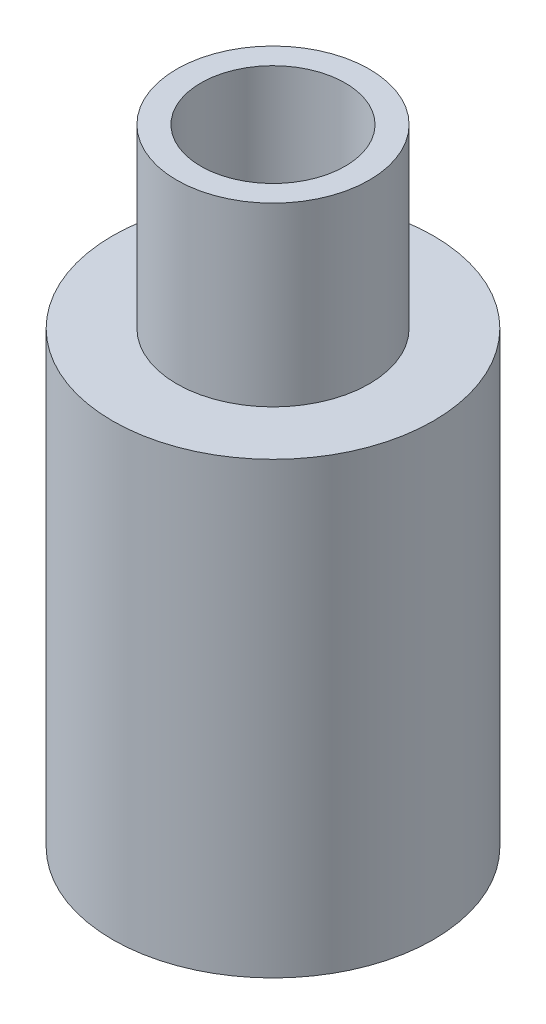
ISO-10303-21;
HEADER;
FILE_DESCRIPTION(('STEP AP214'),'2;1');
FILE_NAME('part.step','',(''),(''),'','','');
FILE_SCHEMA(('AUTOMOTIVE_DESIGN { 1 0 10303 214 1 1 1 1 }'));
ENDSEC;
DATA;
#1=APPLICATION_CONTEXT('core data for automotive mechanical design processes');
#2=APPLICATION_PROTOCOL_DEFINITION('international standard','automotive_design',2000,#1);
#3=PRODUCT_CONTEXT('',#1,'mechanical');
#4=PRODUCT('Part','Part','',(#3));
#5=PRODUCT_RELATED_PRODUCT_CATEGORY('part','',(#4));
#6=PRODUCT_DEFINITION_FORMATION('','',#4);
#7=PRODUCT_DEFINITION_CONTEXT('part definition',#1,'design');
#8=PRODUCT_DEFINITION('design','',#6,#7);
#9=PRODUCT_DEFINITION_SHAPE('','',#8);
#10=(LENGTH_UNIT() NAMED_UNIT(*) SI_UNIT(.MILLI.,.METRE.));
#11=(NAMED_UNIT(*) PLANE_ANGLE_UNIT() SI_UNIT($,.RADIAN.));
#12=(NAMED_UNIT(*) SI_UNIT($,.STERADIAN.) SOLID_ANGLE_UNIT());
#13=UNCERTAINTY_MEASURE_WITH_UNIT(LENGTH_MEASURE(1.E-05),#10,'distance_accuracy_value','');
#14=(GEOMETRIC_REPRESENTATION_CONTEXT(3) GLOBAL_UNCERTAINTY_ASSIGNED_CONTEXT((#13)) GLOBAL_UNIT_ASSIGNED_CONTEXT((#10,
#11,#12)) REPRESENTATION_CONTEXT('',''));
#15=CARTESIAN_POINT('',(0.,0.,0.));
#16=DIRECTION('',(0.,0.,1.));
#17=DIRECTION('',(1.,0.,0.));
#18=AXIS2_PLACEMENT_3D('',#15,#16,#17);
#19=CARTESIAN_POINT('',(0.,14.,0.));
#20=DIRECTION('',(0.,1.,0.));
#21=DIRECTION('',(0.,0.,1.));
#22=AXIS2_PLACEMENT_3D('',#19,#20,#21);
#23=PLANE('',#22);
#24=CARTESIAN_POINT('',(0.,14.,0.));
#25=DIRECTION('',(0.,1.,0.));
#26=DIRECTION('',(0.,0.,1.));
#27=AXIS2_PLACEMENT_3D('',#24,#25,#26);
#28=CIRCLE('',#27,5.);
#29=CARTESIAN_POINT('',(0.,14.,5.));
#30=VERTEX_POINT('',#29);
#31=EDGE_CURVE('E10',#30,#30,#28,.T.);
#32=ORIENTED_EDGE('',*,*,#31,.T.);
#33=EDGE_LOOP('',(#32));
#34=FACE_BOUND('',#33,.T.);
#35=CARTESIAN_POINT('',(0.,14.,0.));
#36=DIRECTION('',(0.,1.,0.));
#37=DIRECTION('',(0.,0.,1.));
#38=AXIS2_PLACEMENT_3D('',#35,#36,#37);
#39=CIRCLE('',#38,3.);
#40=CARTESIAN_POINT('',(0.,14.,3.));
#41=VERTEX_POINT('',#40);
#42=EDGE_CURVE('E42',#41,#41,#39,.T.);
#43=ORIENTED_EDGE('',*,*,#42,.F.);
#44=EDGE_LOOP('',(#43));
#45=FACE_BOUND('',#44,.T.);
#46=ADVANCED_FACE('F29',(#34,#45),#23,.T.);
#47=CARTESIAN_POINT('',(0.,14.,0.));
#48=DIRECTION('',(0.,-1.,0.));
#49=DIRECTION('',(0.,0.,-1.));
#50=AXIS2_PLACEMENT_3D('',#47,#48,#49);
#51=CYLINDRICAL_SURFACE('',#50,5.);
#52=ORIENTED_EDGE('',*,*,#31,.F.);
#53=EDGE_LOOP('',(#52));
#54=FACE_BOUND('',#53,.T.);
#55=CARTESIAN_POINT('',(0.,0.,0.));
#56=DIRECTION('',(0.,1.,0.));
#57=DIRECTION('',(0.,0.,1.));
#58=AXIS2_PLACEMENT_3D('',#55,#56,#57);
#59=CIRCLE('',#58,5.);
#60=CARTESIAN_POINT('',(0.,0.,5.));
#61=VERTEX_POINT('',#60);
#62=EDGE_CURVE('E33',#61,#61,#59,.T.);
#63=ORIENTED_EDGE('',*,*,#62,.T.);
#64=EDGE_LOOP('',(#63));
#65=FACE_BOUND('',#64,.T.);
#66=ADVANCED_FACE('F31',(#54,#65),#51,.T.);
#67=CARTESIAN_POINT('',(0.,0.,0.));
#68=DIRECTION('',(0.,1.,0.));
#69=DIRECTION('',(0.,0.,1.));
#70=AXIS2_PLACEMENT_3D('',#67,#68,#69);
#71=PLANE('',#70);
#72=CARTESIAN_POINT('',(0.,0.,0.));
#73=DIRECTION('',(0.,1.,0.));
#74=DIRECTION('',(0.,0.,1.));
#75=AXIS2_PLACEMENT_3D('',#72,#73,#74);
#76=CIRCLE('',#75,2.25);
#77=CARTESIAN_POINT('',(0.,0.,2.25));
#78=VERTEX_POINT('',#77);
#79=EDGE_CURVE('E45',#78,#78,#76,.T.);
#80=ORIENTED_EDGE('',*,*,#79,.T.);
#81=EDGE_LOOP('',(#80));
#82=FACE_BOUND('',#81,.T.);
#83=ORIENTED_EDGE('',*,*,#62,.F.);
#84=EDGE_LOOP('',(#83));
#85=FACE_BOUND('',#84,.T.);
#86=ADVANCED_FACE('F54',(#82,#85),#71,.F.);
#87=CARTESIAN_POINT('',(0.,19.5,0.));
#88=DIRECTION('',(0.,-1.,0.));
#89=DIRECTION('',(0.,0.,-1.));
#90=AXIS2_PLACEMENT_3D('',#87,#88,#89);
#91=CYLINDRICAL_SURFACE('',#90,3.);
#92=CARTESIAN_POINT('',(0.,19.5,0.));
#93=DIRECTION('',(0.,1.,0.));
#94=DIRECTION('',(0.,0.,1.));
#95=AXIS2_PLACEMENT_3D('',#92,#93,#94);
#96=CIRCLE('',#95,3.);
#97=CARTESIAN_POINT('',(0.,19.5,3.));
#98=VERTEX_POINT('',#97);
#99=EDGE_CURVE('E40',#98,#98,#96,.T.);
#100=ORIENTED_EDGE('',*,*,#99,.F.);
#101=EDGE_LOOP('',(#100));
#102=FACE_BOUND('',#101,.T.);
#103=ORIENTED_EDGE('',*,*,#42,.T.);
#104=EDGE_LOOP('',(#103));
#105=FACE_BOUND('',#104,.T.);
#106=ADVANCED_FACE('F66',(#102,#105),#91,.T.);
#107=CARTESIAN_POINT('',(0.,19.5,0.));
#108=DIRECTION('',(0.,1.,0.));
#109=DIRECTION('',(0.,0.,1.));
#110=AXIS2_PLACEMENT_3D('',#107,#108,#109);
#111=PLANE('',#110);
#112=CARTESIAN_POINT('',(0.,19.5,0.));
#113=DIRECTION('',(0.,1.,0.));
#114=DIRECTION('',(0.,0.,1.));
#115=AXIS2_PLACEMENT_3D('',#112,#113,#114);
#116=CIRCLE('',#115,2.25);
#117=CARTESIAN_POINT('',(0.,19.5,2.25));
#118=VERTEX_POINT('',#117);
#119=EDGE_CURVE('E48',#118,#118,#116,.T.);
#120=ORIENTED_EDGE('',*,*,#119,.F.);
#121=EDGE_LOOP('',(#120));
#122=FACE_BOUND('',#121,.T.);
#123=ORIENTED_EDGE('',*,*,#99,.T.);
#124=EDGE_LOOP('',(#123));
#125=FACE_BOUND('',#124,.T.);
#126=ADVANCED_FACE('F60',(#122,#125),#111,.T.);
#127=CARTESIAN_POINT('',(0.,0.,0.));
#128=DIRECTION('',(0.,1.,0.));
#129=DIRECTION('',(0.,0.,1.));
#130=AXIS2_PLACEMENT_3D('',#127,#128,#129);
#131=CYLINDRICAL_SURFACE('',#130,2.25);
#132=ORIENTED_EDGE('',*,*,#79,.F.);
#133=EDGE_LOOP('',(#132));
#134=FACE_BOUND('',#133,.T.);
#135=ORIENTED_EDGE('',*,*,#119,.T.);
#136=EDGE_LOOP('',(#135));
#137=FACE_BOUND('',#136,.T.);
#138=ADVANCED_FACE('F57',(#134,#137),#131,.F.);
#139=CLOSED_SHELL('',(#46,#66,#86,#106,#126,#138));
#140=MANIFOLD_SOLID_BREP('B2',#139);
#141=ADVANCED_BREP_SHAPE_REPRESENTATION('',(#18,#140),#14);
#142=SHAPE_DEFINITION_REPRESENTATION(#9,#141);
ENDSEC;
END-ISO-10303-21;
